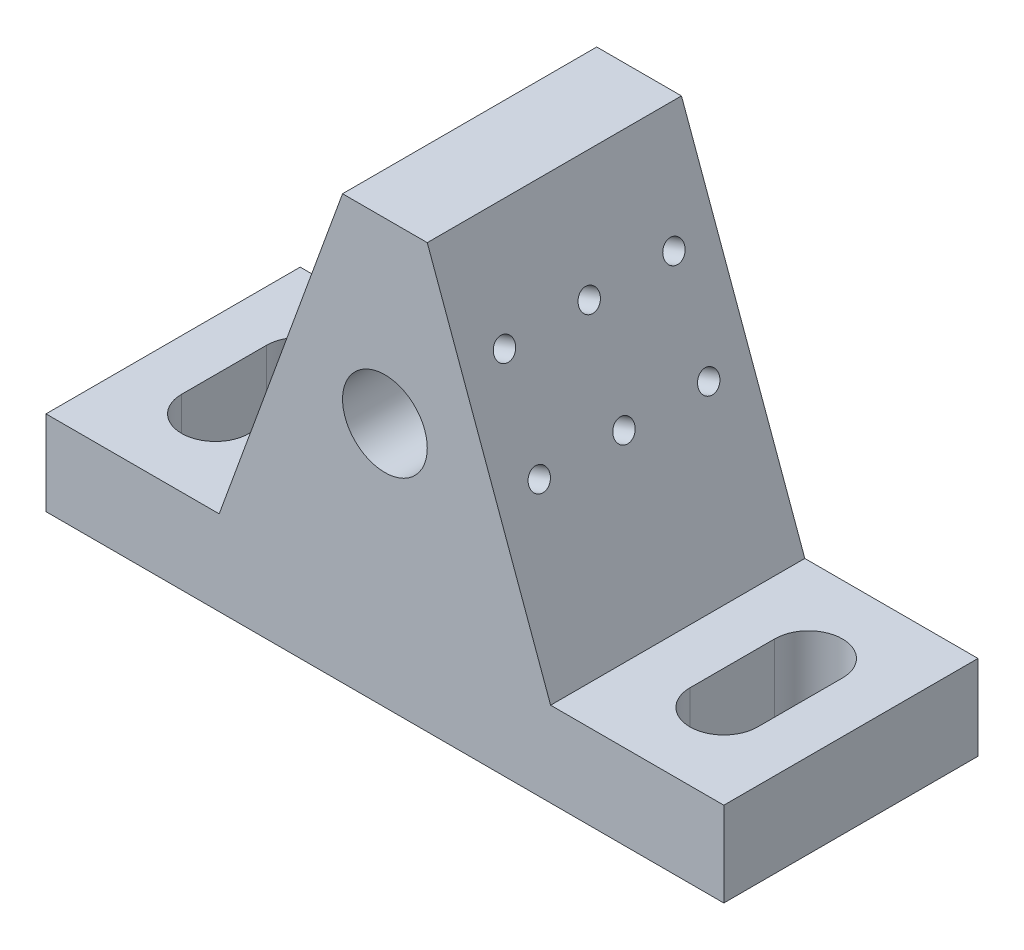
ISO-10303-21;
HEADER;
FILE_DESCRIPTION(('STEP AP214'),'2;1');
FILE_NAME('part.step','',(''),(''),'','','');
FILE_SCHEMA(('AUTOMOTIVE_DESIGN { 1 0 10303 214 1 1 1 1 }'));
ENDSEC;
DATA;
#1=APPLICATION_CONTEXT('core data for automotive mechanical design processes');
#2=APPLICATION_PROTOCOL_DEFINITION('international standard','automotive_design',2000,#1);
#3=PRODUCT_CONTEXT('',#1,'mechanical');
#4=PRODUCT('Part','Part','',(#3));
#5=PRODUCT_RELATED_PRODUCT_CATEGORY('part','',(#4));
#6=PRODUCT_DEFINITION_FORMATION('','',#4);
#7=PRODUCT_DEFINITION_CONTEXT('part definition',#1,'design');
#8=PRODUCT_DEFINITION('design','',#6,#7);
#9=PRODUCT_DEFINITION_SHAPE('','',#8);
#10=(LENGTH_UNIT() NAMED_UNIT(*) SI_UNIT(.MILLI.,.METRE.));
#11=(NAMED_UNIT(*) PLANE_ANGLE_UNIT() SI_UNIT($,.RADIAN.));
#12=(NAMED_UNIT(*) SI_UNIT($,.STERADIAN.) SOLID_ANGLE_UNIT());
#13=UNCERTAINTY_MEASURE_WITH_UNIT(LENGTH_MEASURE(1.E-05),#10,'distance_accuracy_value','');
#14=(GEOMETRIC_REPRESENTATION_CONTEXT(3) GLOBAL_UNCERTAINTY_ASSIGNED_CONTEXT((#13)) GLOBAL_UNIT_ASSIGNED_CONTEXT((#10,
#11,#12)) REPRESENTATION_CONTEXT('',''));
#15=CARTESIAN_POINT('',(0.,0.,0.));
#16=DIRECTION('',(0.,0.,1.));
#17=DIRECTION('',(1.,0.,0.));
#18=AXIS2_PLACEMENT_3D('',#15,#16,#17);
#19=CARTESIAN_POINT('',(-40.,0.,15.));
#20=DIRECTION('',(1.,0.,0.));
#21=DIRECTION('',(0.,0.,-1.));
#22=AXIS2_PLACEMENT_3D('',#19,#20,#21);
#23=PLANE('',#22);
#24=DIRECTION('',(0.,-1.,0.));
#25=VECTOR('',#24,1.);
#26=CARTESIAN_POINT('',(-40.,0.,-15.));
#27=LINE('',#26,#25);
#28=CARTESIAN_POINT('',(-40.,10.,-15.));
#29=VERTEX_POINT('',#28);
#30=CARTESIAN_POINT('',(-40.,0.,-15.));
#31=VERTEX_POINT('',#30);
#32=EDGE_CURVE('E248',#29,#31,#27,.T.);
#33=ORIENTED_EDGE('',*,*,#32,.T.);
#34=DIRECTION('',(0.,0.,-1.));
#35=VECTOR('',#34,1.);
#36=CARTESIAN_POINT('',(-40.,0.,15.));
#37=LINE('',#36,#35);
#38=CARTESIAN_POINT('',(-40.,0.,15.));
#39=VERTEX_POINT('',#38);
#40=EDGE_CURVE('E309',#39,#31,#37,.T.);
#41=ORIENTED_EDGE('',*,*,#40,.F.);
#42=DIRECTION('',(0.,-1.,0.));
#43=VECTOR('',#42,1.);
#44=CARTESIAN_POINT('',(-40.,0.,15.));
#45=LINE('',#44,#43);
#46=CARTESIAN_POINT('',(-40.,10.,15.));
#47=VERTEX_POINT('',#46);
#48=EDGE_CURVE('E255',#47,#39,#45,.T.);
#49=ORIENTED_EDGE('',*,*,#48,.F.);
#50=DIRECTION('',(0.,0.,-1.));
#51=VECTOR('',#50,1.);
#52=CARTESIAN_POINT('',(-40.,10.,15.));
#53=LINE('',#52,#51);
#54=EDGE_CURVE('E273',#47,#29,#53,.T.);
#55=ORIENTED_EDGE('',*,*,#54,.T.);
#56=EDGE_LOOP('',(#33,#41,#49,#55));
#57=FACE_BOUND('',#56,.T.);
#58=ADVANCED_FACE('F40',(#57),#23,.F.);
#59=CARTESIAN_POINT('',(-40.,0.,15.));
#60=DIRECTION('',(0.,1.,0.));
#61=DIRECTION('',(0.,0.,1.));
#62=AXIS2_PLACEMENT_3D('',#59,#60,#61);
#63=PLANE('',#62);
#64=DIRECTION('',(0.,0.,-1.));
#65=VECTOR('',#64,1.);
#66=CARTESIAN_POINT('',(-34.,0.,5.));
#67=LINE('',#66,#65);
#68=CARTESIAN_POINT('',(-34.,0.,5.));
#69=VERTEX_POINT('',#68);
#70=CARTESIAN_POINT('',(-34.,0.,-5.));
#71=VERTEX_POINT('',#70);
#72=EDGE_CURVE('E193',#69,#71,#67,.T.);
#73=ORIENTED_EDGE('',*,*,#72,.F.);
#74=CARTESIAN_POINT('',(-30.,0.,5.));
#75=DIRECTION('',(0.,-1.,0.));
#76=DIRECTION('',(1.,0.,0.));
#77=AXIS2_PLACEMENT_3D('',#74,#75,#76);
#78=CIRCLE('',#77,4.);
#79=CARTESIAN_POINT('',(-26.,0.,5.));
#80=VERTEX_POINT('',#79);
#81=EDGE_CURVE('E220',#80,#69,#78,.T.);
#82=ORIENTED_EDGE('',*,*,#81,.F.);
#83=DIRECTION('',(0.,0.,1.));
#84=VECTOR('',#83,1.);
#85=CARTESIAN_POINT('',(-26.,0.,5.));
#86=LINE('',#85,#84);
#87=CARTESIAN_POINT('',(-26.,0.,-5.));
#88=VERTEX_POINT('',#87);
#89=EDGE_CURVE('E214',#88,#80,#86,.T.);
#90=ORIENTED_EDGE('',*,*,#89,.F.);
#91=CARTESIAN_POINT('',(-30.,0.,-5.));
#92=DIRECTION('',(0.,-1.,0.));
#93=DIRECTION('',(1.,0.,0.));
#94=AXIS2_PLACEMENT_3D('',#91,#92,#93);
#95=CIRCLE('',#94,4.);
#96=EDGE_CURVE('E206',#71,#88,#95,.T.);
#97=ORIENTED_EDGE('',*,*,#96,.F.);
#98=EDGE_LOOP('',(#73,#82,#90,#97));
#99=FACE_BOUND('',#98,.T.);
#100=DIRECTION('',(0.,0.,1.));
#101=VECTOR('',#100,1.);
#102=CARTESIAN_POINT('',(26.,0.,5.));
#103=LINE('',#102,#101);
#104=CARTESIAN_POINT('',(26.,0.,-5.));
#105=VERTEX_POINT('',#104);
#106=CARTESIAN_POINT('',(26.,0.,5.));
#107=VERTEX_POINT('',#106);
#108=EDGE_CURVE('E233',#105,#107,#103,.T.);
#109=ORIENTED_EDGE('',*,*,#108,.T.);
#110=CARTESIAN_POINT('',(30.,0.,5.));
#111=DIRECTION('',(0.,1.,0.));
#112=DIRECTION('',(-1.,0.,0.));
#113=AXIS2_PLACEMENT_3D('',#110,#111,#112);
#114=CIRCLE('',#113,4.);
#115=CARTESIAN_POINT('',(34.,0.,5.));
#116=VERTEX_POINT('',#115);
#117=EDGE_CURVE('E223',#107,#116,#114,.T.);
#118=ORIENTED_EDGE('',*,*,#117,.T.);
#119=DIRECTION('',(0.,0.,-1.));
#120=VECTOR('',#119,1.);
#121=CARTESIAN_POINT('',(34.,0.,5.));
#122=LINE('',#121,#120);
#123=CARTESIAN_POINT('',(34.,0.,-5.));
#124=VERTEX_POINT('',#123);
#125=EDGE_CURVE('E226',#116,#124,#122,.T.);
#126=ORIENTED_EDGE('',*,*,#125,.T.);
#127=CARTESIAN_POINT('',(30.,0.,-5.));
#128=DIRECTION('',(0.,1.,0.));
#129=DIRECTION('',(-1.,0.,0.));
#130=AXIS2_PLACEMENT_3D('',#127,#128,#129);
#131=CIRCLE('',#130,4.);
#132=EDGE_CURVE('E230',#124,#105,#131,.T.);
#133=ORIENTED_EDGE('',*,*,#132,.T.);
#134=EDGE_LOOP('',(#109,#118,#126,#133));
#135=FACE_BOUND('',#134,.T.);
#136=DIRECTION('',(1.,0.,0.));
#137=VECTOR('',#136,1.);
#138=CARTESIAN_POINT('',(-40.,0.,-15.));
#139=LINE('',#138,#137);
#140=CARTESIAN_POINT('',(40.,0.,-15.));
#141=VERTEX_POINT('',#140);
#142=EDGE_CURVE('E276',#31,#141,#139,.T.);
#143=ORIENTED_EDGE('',*,*,#142,.T.);
#144=DIRECTION('',(0.,0.,-1.));
#145=VECTOR('',#144,1.);
#146=CARTESIAN_POINT('',(40.,0.,15.));
#147=LINE('',#146,#145);
#148=CARTESIAN_POINT('',(40.,0.,15.));
#149=VERTEX_POINT('',#148);
#150=EDGE_CURVE('E306',#149,#141,#147,.T.);
#151=ORIENTED_EDGE('',*,*,#150,.F.);
#152=DIRECTION('',(1.,0.,0.));
#153=VECTOR('',#152,1.);
#154=CARTESIAN_POINT('',(-40.,0.,15.));
#155=LINE('',#154,#153);
#156=EDGE_CURVE('E258',#39,#149,#155,.T.);
#157=ORIENTED_EDGE('',*,*,#156,.F.);
#158=ORIENTED_EDGE('',*,*,#40,.T.);
#159=EDGE_LOOP('',(#143,#151,#157,#158));
#160=FACE_BOUND('',#159,.T.);
#161=ADVANCED_FACE('F352',(#99,#135,#160),#63,.F.);
#162=CARTESIAN_POINT('',(40.,0.,15.));
#163=DIRECTION('',(-1.,0.,0.));
#164=DIRECTION('',(0.,0.,1.));
#165=AXIS2_PLACEMENT_3D('',#162,#163,#164);
#166=PLANE('',#165);
#167=DIRECTION('',(0.,1.,0.));
#168=VECTOR('',#167,1.);
#169=CARTESIAN_POINT('',(40.,0.,-15.));
#170=LINE('',#169,#168);
#171=CARTESIAN_POINT('',(40.,10.,-15.));
#172=VERTEX_POINT('',#171);
#173=EDGE_CURVE('E278',#141,#172,#170,.T.);
#174=ORIENTED_EDGE('',*,*,#173,.T.);
#175=DIRECTION('',(0.,0.,-1.));
#176=VECTOR('',#175,1.);
#177=CARTESIAN_POINT('',(40.,10.,15.));
#178=LINE('',#177,#176);
#179=CARTESIAN_POINT('',(40.,10.,15.));
#180=VERTEX_POINT('',#179);
#181=EDGE_CURVE('E303',#180,#172,#178,.T.);
#182=ORIENTED_EDGE('',*,*,#181,.F.);
#183=DIRECTION('',(0.,1.,0.));
#184=VECTOR('',#183,1.);
#185=CARTESIAN_POINT('',(40.,0.,15.));
#186=LINE('',#185,#184);
#187=EDGE_CURVE('E261',#149,#180,#186,.T.);
#188=ORIENTED_EDGE('',*,*,#187,.F.);
#189=ORIENTED_EDGE('',*,*,#150,.T.);
#190=EDGE_LOOP('',(#174,#182,#188,#189));
#191=FACE_BOUND('',#190,.T.);
#192=ADVANCED_FACE('F346',(#191),#166,.F.);
#193=CARTESIAN_POINT('',(40.,10.,15.));
#194=DIRECTION('',(0.,-1.,0.));
#195=DIRECTION('',(1.,0.,0.));
#196=AXIS2_PLACEMENT_3D('',#193,#194,#195);
#197=PLANE('',#196);
#198=DIRECTION('',(0.,0.,-1.));
#199=VECTOR('',#198,1.);
#200=CARTESIAN_POINT('',(34.,10.,5.));
#201=LINE('',#200,#199);
#202=CARTESIAN_POINT('',(34.,10.,5.));
#203=VERTEX_POINT('',#202);
#204=CARTESIAN_POINT('',(34.,10.,-5.));
#205=VERTEX_POINT('',#204);
#206=EDGE_CURVE('E238',#203,#205,#201,.T.);
#207=ORIENTED_EDGE('',*,*,#206,.F.);
#208=CARTESIAN_POINT('',(30.,10.,5.));
#209=DIRECTION('',(0.,1.,0.));
#210=DIRECTION('',(-1.,0.,0.));
#211=AXIS2_PLACEMENT_3D('',#208,#209,#210);
#212=CIRCLE('',#211,4.);
#213=CARTESIAN_POINT('',(26.,10.,5.));
#214=VERTEX_POINT('',#213);
#215=EDGE_CURVE('E222',#214,#203,#212,.T.);
#216=ORIENTED_EDGE('',*,*,#215,.F.);
#217=DIRECTION('',(0.,0.,1.));
#218=VECTOR('',#217,1.);
#219=CARTESIAN_POINT('',(26.,10.,5.));
#220=LINE('',#219,#218);
#221=CARTESIAN_POINT('',(26.,10.,-5.));
#222=VERTEX_POINT('',#221);
#223=EDGE_CURVE('E227',#222,#214,#220,.T.);
#224=ORIENTED_EDGE('',*,*,#223,.F.);
#225=CARTESIAN_POINT('',(30.,10.,-5.));
#226=DIRECTION('',(0.,1.,0.));
#227=DIRECTION('',(-1.,0.,0.));
#228=AXIS2_PLACEMENT_3D('',#225,#226,#227);
#229=CIRCLE('',#228,4.);
#230=EDGE_CURVE('E241',#205,#222,#229,.T.);
#231=ORIENTED_EDGE('',*,*,#230,.F.);
#232=EDGE_LOOP('',(#207,#216,#224,#231));
#233=FACE_BOUND('',#232,.T.);
#234=DIRECTION('',(-1.,0.,0.));
#235=VECTOR('',#234,1.);
#236=CARTESIAN_POINT('',(40.,10.,-15.));
#237=LINE('',#236,#235);
#238=CARTESIAN_POINT('',(19.558809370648,10.,-15.));
#239=VERTEX_POINT('',#238);
#240=EDGE_CURVE('E280',#172,#239,#237,.T.);
#241=ORIENTED_EDGE('',*,*,#240,.T.);
#242=DIRECTION('',(0.,0.,-1.));
#243=VECTOR('',#242,1.);
#244=CARTESIAN_POINT('',(19.558809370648,10.,15.));
#245=LINE('',#244,#243);
#246=CARTESIAN_POINT('',(19.558809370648,10.,15.));
#247=VERTEX_POINT('',#246);
#248=EDGE_CURVE('E300',#247,#239,#245,.T.);
#249=ORIENTED_EDGE('',*,*,#248,.F.);
#250=DIRECTION('',(-1.,0.,0.));
#251=VECTOR('',#250,1.);
#252=CARTESIAN_POINT('',(40.,10.,15.));
#253=LINE('',#252,#251);
#254=EDGE_CURVE('E263',#180,#247,#253,.T.);
#255=ORIENTED_EDGE('',*,*,#254,.F.);
#256=ORIENTED_EDGE('',*,*,#181,.T.);
#257=EDGE_LOOP('',(#241,#249,#255,#256));
#258=FACE_BOUND('',#257,.T.);
#259=ADVANCED_FACE('F336',(#233,#258),#197,.F.);
#260=CARTESIAN_POINT('',(19.558809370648,10.,15.));
#261=DIRECTION('',(-0.939692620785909,-0.342020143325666,0.));
#262=DIRECTION('',(0.342020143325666,-0.93969262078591,0.));
#263=AXIS2_PLACEMENT_3D('',#260,#261,#262);
#264=PLANE('',#263);
#265=CARTESIAN_POINT('',(13.2165018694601,27.4253466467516,0.));
#266=DIRECTION('',(0.939692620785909,0.342020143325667,0.));
#267=DIRECTION('',(-0.342020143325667,0.939692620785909,0.));
#268=AXIS2_PLACEMENT_3D('',#265,#266,#267);
#269=CIRCLE('',#268,1.25);
#270=CARTESIAN_POINT('',(12.788976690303,28.599962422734,0.));
#271=VERTEX_POINT('',#270);
#272=EDGE_CURVE('E174',#271,#271,#269,.T.);
#273=ORIENTED_EDGE('',*,*,#272,.F.);
#274=EDGE_LOOP('',(#273));
#275=FACE_BOUND('',#274,.T.);
#276=CARTESIAN_POINT('',(13.2165018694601,27.4253466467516,10.));
#277=DIRECTION('',(0.939692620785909,0.342020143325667,0.));
#278=DIRECTION('',(-0.342020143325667,0.939692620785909,0.));
#279=AXIS2_PLACEMENT_3D('',#276,#277,#278);
#280=CIRCLE('',#279,1.25);
#281=CARTESIAN_POINT('',(12.788976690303,28.599962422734,10.));
#282=VERTEX_POINT('',#281);
#283=EDGE_CURVE('E173',#282,#282,#280,.T.);
#284=ORIENTED_EDGE('',*,*,#283,.F.);
#285=EDGE_LOOP('',(#284));
#286=FACE_BOUND('',#285,.T.);
#287=DIRECTION('',(-0.342020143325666,0.939692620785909,0.));
#288=VECTOR('',#287,1.);
#289=CARTESIAN_POINT('',(19.558809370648,10.,-15.));
#290=LINE('',#289,#288);
#291=CARTESIAN_POINT('',(5.,50.,-15.));
#292=VERTEX_POINT('',#291);
#293=EDGE_CURVE('E282',#239,#292,#290,.T.);
#294=ORIENTED_EDGE('',*,*,#293,.T.);
#295=DIRECTION('',(0.,0.,-1.));
#296=VECTOR('',#295,1.);
#297=CARTESIAN_POINT('',(5.,50.,15.));
#298=LINE('',#297,#296);
#299=CARTESIAN_POINT('',(5.,50.,15.));
#300=VERTEX_POINT('',#299);
#301=EDGE_CURVE('E297',#300,#292,#298,.T.);
#302=ORIENTED_EDGE('',*,*,#301,.F.);
#303=DIRECTION('',(-0.342020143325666,0.939692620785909,0.));
#304=VECTOR('',#303,1.);
#305=CARTESIAN_POINT('',(19.558809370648,10.,15.));
#306=LINE('',#305,#304);
#307=EDGE_CURVE('E265',#247,#300,#306,.T.);
#308=ORIENTED_EDGE('',*,*,#307,.F.);
#309=ORIENTED_EDGE('',*,*,#248,.T.);
#310=EDGE_LOOP('',(#294,#302,#308,#309));
#311=FACE_BOUND('',#310,.T.);
#312=CARTESIAN_POINT('',(13.2165018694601,27.4253466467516,-10.));
#313=DIRECTION('',(0.939692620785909,0.342020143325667,0.));
#314=DIRECTION('',(-0.342020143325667,0.939692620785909,0.));
#315=AXIS2_PLACEMENT_3D('',#312,#313,#314);
#316=CIRCLE('',#315,1.25);
#317=CARTESIAN_POINT('',(12.788976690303,28.599962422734,-10.));
#318=VERTEX_POINT('',#317);
#319=EDGE_CURVE('E312',#318,#318,#316,.T.);
#320=ORIENTED_EDGE('',*,*,#319,.F.);
#321=EDGE_LOOP('',(#320));
#322=FACE_BOUND('',#321,.T.);
#323=CARTESIAN_POINT('',(9.11226014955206,38.7016580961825,10.));
#324=DIRECTION('',(0.939692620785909,0.342020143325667,0.));
#325=DIRECTION('',(-0.342020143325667,0.939692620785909,0.));
#326=AXIS2_PLACEMENT_3D('',#323,#324,#325);
#327=CIRCLE('',#326,1.25);
#328=CARTESIAN_POINT('',(8.68473497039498,39.8762738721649,10.));
#329=VERTEX_POINT('',#328);
#330=EDGE_CURVE('E318',#329,#329,#327,.T.);
#331=ORIENTED_EDGE('',*,*,#330,.F.);
#332=EDGE_LOOP('',(#331));
#333=FACE_BOUND('',#332,.T.);
#334=CARTESIAN_POINT('',(9.11226014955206,38.7016580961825,0.));
#335=DIRECTION('',(0.939692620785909,0.342020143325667,0.));
#336=DIRECTION('',(-0.342020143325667,0.939692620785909,0.));
#337=AXIS2_PLACEMENT_3D('',#334,#335,#336);
#338=CIRCLE('',#337,1.25);
#339=CARTESIAN_POINT('',(8.68473497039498,39.8762738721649,0.));
#340=VERTEX_POINT('',#339);
#341=EDGE_CURVE('E324',#340,#340,#338,.T.);
#342=ORIENTED_EDGE('',*,*,#341,.F.);
#343=EDGE_LOOP('',(#342));
#344=FACE_BOUND('',#343,.T.);
#345=CARTESIAN_POINT('',(9.11226014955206,38.7016580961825,-10.));
#346=DIRECTION('',(0.939692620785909,0.342020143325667,0.));
#347=DIRECTION('',(-0.342020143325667,0.939692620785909,0.));
#348=AXIS2_PLACEMENT_3D('',#345,#346,#347);
#349=CIRCLE('',#348,1.25);
#350=CARTESIAN_POINT('',(8.68473497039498,39.8762738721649,-10.));
#351=VERTEX_POINT('',#350);
#352=EDGE_CURVE('E48',#351,#351,#349,.T.);
#353=ORIENTED_EDGE('',*,*,#352,.F.);
#354=EDGE_LOOP('',(#353));
#355=FACE_BOUND('',#354,.T.);
#356=ADVANCED_FACE('F333',(#275,#286,#311,#322,#333,#344,#355),#264,.F.);
#357=CARTESIAN_POINT('',(5.,50.,15.));
#358=DIRECTION('',(0.,-1.,0.));
#359=DIRECTION('',(0.,0.,-1.));
#360=AXIS2_PLACEMENT_3D('',#357,#358,#359);
#361=PLANE('',#360);
#362=DIRECTION('',(-1.,0.,0.));
#363=VECTOR('',#362,1.);
#364=CARTESIAN_POINT('',(5.,50.,-15.));
#365=LINE('',#364,#363);
#366=CARTESIAN_POINT('',(-5.,50.,-15.));
#367=VERTEX_POINT('',#366);
#368=EDGE_CURVE('E284',#292,#367,#365,.T.);
#369=ORIENTED_EDGE('',*,*,#368,.T.);
#370=DIRECTION('',(0.,0.,-1.));
#371=VECTOR('',#370,1.);
#372=CARTESIAN_POINT('',(-5.,50.,15.));
#373=LINE('',#372,#371);
#374=CARTESIAN_POINT('',(-5.,50.,15.));
#375=VERTEX_POINT('',#374);
#376=EDGE_CURVE('E294',#375,#367,#373,.T.);
#377=ORIENTED_EDGE('',*,*,#376,.F.);
#378=DIRECTION('',(-1.,0.,0.));
#379=VECTOR('',#378,1.);
#380=CARTESIAN_POINT('',(5.,50.,15.));
#381=LINE('',#380,#379);
#382=EDGE_CURVE('E267',#300,#375,#381,.T.);
#383=ORIENTED_EDGE('',*,*,#382,.F.);
#384=ORIENTED_EDGE('',*,*,#301,.T.);
#385=EDGE_LOOP('',(#369,#377,#383,#384));
#386=FACE_BOUND('',#385,.T.);
#387=ADVANCED_FACE('F335',(#386),#361,.F.);
#388=CARTESIAN_POINT('',(-19.558809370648,10.,15.));
#389=DIRECTION('',(0.939692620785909,-0.342020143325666,0.));
#390=DIRECTION('',(0.342020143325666,0.93969262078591,0.));
#391=AXIS2_PLACEMENT_3D('',#388,#389,#390);
#392=PLANE('',#391);
#393=DIRECTION('',(-0.342020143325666,-0.939692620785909,0.));
#394=VECTOR('',#393,1.);
#395=CARTESIAN_POINT('',(-19.558809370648,10.,-15.));
#396=LINE('',#395,#394);
#397=CARTESIAN_POINT('',(-19.558809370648,10.,-15.));
#398=VERTEX_POINT('',#397);
#399=EDGE_CURVE('E286',#367,#398,#396,.T.);
#400=ORIENTED_EDGE('',*,*,#399,.T.);
#401=DIRECTION('',(0.,0.,-1.));
#402=VECTOR('',#401,1.);
#403=CARTESIAN_POINT('',(-19.558809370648,10.,15.));
#404=LINE('',#403,#402);
#405=CARTESIAN_POINT('',(-19.558809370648,10.,15.));
#406=VERTEX_POINT('',#405);
#407=EDGE_CURVE('E291',#406,#398,#404,.T.);
#408=ORIENTED_EDGE('',*,*,#407,.F.);
#409=DIRECTION('',(-0.342020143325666,-0.939692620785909,0.));
#410=VECTOR('',#409,1.);
#411=CARTESIAN_POINT('',(-19.558809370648,10.,15.));
#412=LINE('',#411,#410);
#413=EDGE_CURVE('E269',#375,#406,#412,.T.);
#414=ORIENTED_EDGE('',*,*,#413,.F.);
#415=ORIENTED_EDGE('',*,*,#376,.T.);
#416=EDGE_LOOP('',(#400,#408,#414,#415));
#417=FACE_BOUND('',#416,.T.);
#418=ADVANCED_FACE('F343',(#417),#392,.F.);
#419=CARTESIAN_POINT('',(-40.,10.,15.));
#420=DIRECTION('',(0.,-1.,0.));
#421=DIRECTION('',(1.,0.,0.));
#422=AXIS2_PLACEMENT_3D('',#419,#420,#421);
#423=PLANE('',#422);
#424=DIRECTION('',(0.,0.,1.));
#425=VECTOR('',#424,1.);
#426=CARTESIAN_POINT('',(-26.,10.,5.));
#427=LINE('',#426,#425);
#428=CARTESIAN_POINT('',(-26.,10.,-5.));
#429=VERTEX_POINT('',#428);
#430=CARTESIAN_POINT('',(-26.,10.,5.));
#431=VERTEX_POINT('',#430);
#432=EDGE_CURVE('E209',#429,#431,#427,.T.);
#433=ORIENTED_EDGE('',*,*,#432,.T.);
#434=CARTESIAN_POINT('',(-30.,10.,5.));
#435=DIRECTION('',(0.,-1.,0.));
#436=DIRECTION('',(1.,0.,0.));
#437=AXIS2_PLACEMENT_3D('',#434,#435,#436);
#438=CIRCLE('',#437,4.);
#439=CARTESIAN_POINT('',(-34.,10.,5.));
#440=VERTEX_POINT('',#439);
#441=EDGE_CURVE('E217',#431,#440,#438,.T.);
#442=ORIENTED_EDGE('',*,*,#441,.T.);
#443=DIRECTION('',(0.,0.,-1.));
#444=VECTOR('',#443,1.);
#445=CARTESIAN_POINT('',(-34.,10.,5.));
#446=LINE('',#445,#444);
#447=CARTESIAN_POINT('',(-34.,10.,-5.));
#448=VERTEX_POINT('',#447);
#449=EDGE_CURVE('E188',#440,#448,#446,.T.);
#450=ORIENTED_EDGE('',*,*,#449,.T.);
#451=CARTESIAN_POINT('',(-30.,10.,-5.));
#452=DIRECTION('',(0.,-1.,0.));
#453=DIRECTION('',(1.,0.,0.));
#454=AXIS2_PLACEMENT_3D('',#451,#452,#453);
#455=CIRCLE('',#454,4.);
#456=EDGE_CURVE('E201',#448,#429,#455,.T.);
#457=ORIENTED_EDGE('',*,*,#456,.T.);
#458=EDGE_LOOP('',(#433,#442,#450,#457));
#459=FACE_BOUND('',#458,.T.);
#460=DIRECTION('',(-1.,0.,0.));
#461=VECTOR('',#460,1.);
#462=CARTESIAN_POINT('',(-40.,10.,-15.));
#463=LINE('',#462,#461);
#464=EDGE_CURVE('E259',#398,#29,#463,.T.);
#465=ORIENTED_EDGE('',*,*,#464,.T.);
#466=ORIENTED_EDGE('',*,*,#54,.F.);
#467=DIRECTION('',(-1.,0.,0.));
#468=VECTOR('',#467,1.);
#469=CARTESIAN_POINT('',(-40.,10.,15.));
#470=LINE('',#469,#468);
#471=EDGE_CURVE('E271',#406,#47,#470,.T.);
#472=ORIENTED_EDGE('',*,*,#471,.F.);
#473=ORIENTED_EDGE('',*,*,#407,.T.);
#474=EDGE_LOOP('',(#465,#466,#472,#473));
#475=FACE_BOUND('',#474,.T.);
#476=ADVANCED_FACE('F539',(#459,#475),#423,.F.);
#477=CARTESIAN_POINT('',(-40.,10.,15.));
#478=DIRECTION('',(0.,0.,-1.));
#479=DIRECTION('',(-1.,0.,0.));
#480=AXIS2_PLACEMENT_3D('',#477,#478,#479);
#481=PLANE('',#480);
#482=CARTESIAN_POINT('',(0.,29.,15.));
#483=DIRECTION('',(0.,0.,1.));
#484=DIRECTION('',(1.,0.,0.));
#485=AXIS2_PLACEMENT_3D('',#482,#483,#484);
#486=CIRCLE('',#485,5.);
#487=CARTESIAN_POINT('',(5.,29.,15.));
#488=VERTEX_POINT('',#487);
#489=EDGE_CURVE('E184',#488,#488,#486,.T.);
#490=ORIENTED_EDGE('',*,*,#489,.F.);
#491=EDGE_LOOP('',(#490));
#492=FACE_BOUND('',#491,.T.);
#493=ORIENTED_EDGE('',*,*,#48,.T.);
#494=ORIENTED_EDGE('',*,*,#156,.T.);
#495=ORIENTED_EDGE('',*,*,#187,.T.);
#496=ORIENTED_EDGE('',*,*,#254,.T.);
#497=ORIENTED_EDGE('',*,*,#307,.T.);
#498=ORIENTED_EDGE('',*,*,#382,.T.);
#499=ORIENTED_EDGE('',*,*,#413,.T.);
#500=ORIENTED_EDGE('',*,*,#471,.T.);
#501=EDGE_LOOP('',(#493,#494,#495,#496,#497,#498,#499,#500));
#502=FACE_BOUND('',#501,.T.);
#503=ADVANCED_FACE('F532',(#492,#502),#481,.F.);
#504=CARTESIAN_POINT('',(-40.,10.,-15.));
#505=DIRECTION('',(0.,0.,-1.));
#506=DIRECTION('',(-1.,0.,0.));
#507=AXIS2_PLACEMENT_3D('',#504,#505,#506);
#508=PLANE('',#507);
#509=CARTESIAN_POINT('',(0.,29.,-15.));
#510=DIRECTION('',(0.,0.,1.));
#511=DIRECTION('',(1.,0.,0.));
#512=AXIS2_PLACEMENT_3D('',#509,#510,#511);
#513=CIRCLE('',#512,5.);
#514=CARTESIAN_POINT('',(5.,29.,-15.));
#515=VERTEX_POINT('',#514);
#516=EDGE_CURVE('E185',#515,#515,#513,.T.);
#517=ORIENTED_EDGE('',*,*,#516,.T.);
#518=EDGE_LOOP('',(#517));
#519=FACE_BOUND('',#518,.T.);
#520=ORIENTED_EDGE('',*,*,#32,.F.);
#521=ORIENTED_EDGE('',*,*,#464,.F.);
#522=ORIENTED_EDGE('',*,*,#399,.F.);
#523=ORIENTED_EDGE('',*,*,#368,.F.);
#524=ORIENTED_EDGE('',*,*,#293,.F.);
#525=ORIENTED_EDGE('',*,*,#240,.F.);
#526=ORIENTED_EDGE('',*,*,#173,.F.);
#527=ORIENTED_EDGE('',*,*,#142,.F.);
#528=EDGE_LOOP('',(#520,#521,#522,#523,#524,#525,#526,#527));
#529=FACE_BOUND('',#528,.T.);
#530=ADVANCED_FACE('F524',(#519,#529),#508,.T.);
#531=CARTESIAN_POINT('',(30.,0.,5.));
#532=DIRECTION('',(0.,1.,0.));
#533=DIRECTION('',(-1.,0.,0.));
#534=AXIS2_PLACEMENT_3D('',#531,#532,#533);
#535=CYLINDRICAL_SURFACE('',#534,4.);
#536=ORIENTED_EDGE('',*,*,#215,.T.);
#537=DIRECTION('',(0.,1.,0.));
#538=VECTOR('',#537,1.);
#539=CARTESIAN_POINT('',(34.,0.,5.));
#540=LINE('',#539,#538);
#541=EDGE_CURVE('E236',#116,#203,#540,.T.);
#542=ORIENTED_EDGE('',*,*,#541,.F.);
#543=ORIENTED_EDGE('',*,*,#117,.F.);
#544=DIRECTION('',(0.,1.,0.));
#545=VECTOR('',#544,1.);
#546=CARTESIAN_POINT('',(26.,0.,5.));
#547=LINE('',#546,#545);
#548=EDGE_CURVE('E246',#107,#214,#547,.T.);
#549=ORIENTED_EDGE('',*,*,#548,.T.);
#550=EDGE_LOOP('',(#536,#542,#543,#549));
#551=FACE_BOUND('',#550,.T.);
#552=ADVANCED_FACE('F516',(#551),#535,.F.);
#553=CARTESIAN_POINT('',(26.,0.,5.));
#554=DIRECTION('',(-1.,0.,0.));
#555=DIRECTION('',(0.,-1.,0.));
#556=AXIS2_PLACEMENT_3D('',#553,#554,#555);
#557=PLANE('',#556);
#558=ORIENTED_EDGE('',*,*,#223,.T.);
#559=ORIENTED_EDGE('',*,*,#548,.F.);
#560=ORIENTED_EDGE('',*,*,#108,.F.);
#561=DIRECTION('',(0.,1.,0.));
#562=VECTOR('',#561,1.);
#563=CARTESIAN_POINT('',(26.,0.,-5.));
#564=LINE('',#563,#562);
#565=EDGE_CURVE('E249',#105,#222,#564,.T.);
#566=ORIENTED_EDGE('',*,*,#565,.T.);
#567=EDGE_LOOP('',(#558,#559,#560,#566));
#568=FACE_BOUND('',#567,.T.);
#569=ADVANCED_FACE('F508',(#568),#557,.F.);
#570=CARTESIAN_POINT('',(30.,0.,-5.));
#571=DIRECTION('',(0.,1.,0.));
#572=DIRECTION('',(-1.,0.,0.));
#573=AXIS2_PLACEMENT_3D('',#570,#571,#572);
#574=CYLINDRICAL_SURFACE('',#573,4.);
#575=ORIENTED_EDGE('',*,*,#230,.T.);
#576=ORIENTED_EDGE('',*,*,#565,.F.);
#577=ORIENTED_EDGE('',*,*,#132,.F.);
#578=DIRECTION('',(0.,1.,0.));
#579=VECTOR('',#578,1.);
#580=CARTESIAN_POINT('',(34.,0.,-5.));
#581=LINE('',#580,#579);
#582=EDGE_CURVE('E251',#124,#205,#581,.T.);
#583=ORIENTED_EDGE('',*,*,#582,.T.);
#584=EDGE_LOOP('',(#575,#576,#577,#583));
#585=FACE_BOUND('',#584,.T.);
#586=ADVANCED_FACE('F499',(#585),#574,.F.);
#587=CARTESIAN_POINT('',(34.,0.,5.));
#588=DIRECTION('',(1.,0.,0.));
#589=DIRECTION('',(0.,1.,0.));
#590=AXIS2_PLACEMENT_3D('',#587,#588,#589);
#591=PLANE('',#590);
#592=ORIENTED_EDGE('',*,*,#206,.T.);
#593=ORIENTED_EDGE('',*,*,#582,.F.);
#594=ORIENTED_EDGE('',*,*,#125,.F.);
#595=ORIENTED_EDGE('',*,*,#541,.T.);
#596=EDGE_LOOP('',(#592,#593,#594,#595));
#597=FACE_BOUND('',#596,.T.);
#598=ADVANCED_FACE('F490',(#597),#591,.F.);
#599=CARTESIAN_POINT('',(-30.,0.,5.));
#600=DIRECTION('',(0.,1.,0.));
#601=DIRECTION('',(1.,0.,0.));
#602=AXIS2_PLACEMENT_3D('',#599,#600,#601);
#603=CYLINDRICAL_SURFACE('',#602,4.);
#604=ORIENTED_EDGE('',*,*,#441,.F.);
#605=DIRECTION('',(0.,1.,0.));
#606=VECTOR('',#605,1.);
#607=CARTESIAN_POINT('',(-26.,0.,5.));
#608=LINE('',#607,#606);
#609=EDGE_CURVE('E212',#80,#431,#608,.T.);
#610=ORIENTED_EDGE('',*,*,#609,.F.);
#611=ORIENTED_EDGE('',*,*,#81,.T.);
#612=DIRECTION('',(0.,1.,0.));
#613=VECTOR('',#612,1.);
#614=CARTESIAN_POINT('',(-34.,0.,5.));
#615=LINE('',#614,#613);
#616=EDGE_CURVE('E199',#69,#440,#615,.T.);
#617=ORIENTED_EDGE('',*,*,#616,.T.);
#618=EDGE_LOOP('',(#604,#610,#611,#617));
#619=FACE_BOUND('',#618,.T.);
#620=ADVANCED_FACE('F482',(#619),#603,.F.);
#621=CARTESIAN_POINT('',(-26.,0.,5.));
#622=DIRECTION('',(1.,0.,0.));
#623=DIRECTION('',(0.,-1.,0.));
#624=AXIS2_PLACEMENT_3D('',#621,#622,#623);
#625=PLANE('',#624);
#626=ORIENTED_EDGE('',*,*,#432,.F.);
#627=DIRECTION('',(0.,1.,0.));
#628=VECTOR('',#627,1.);
#629=CARTESIAN_POINT('',(-26.,0.,-5.));
#630=LINE('',#629,#628);
#631=EDGE_CURVE('E204',#88,#429,#630,.T.);
#632=ORIENTED_EDGE('',*,*,#631,.F.);
#633=ORIENTED_EDGE('',*,*,#89,.T.);
#634=ORIENTED_EDGE('',*,*,#609,.T.);
#635=EDGE_LOOP('',(#626,#632,#633,#634));
#636=FACE_BOUND('',#635,.T.);
#637=ADVANCED_FACE('F474',(#636),#625,.F.);
#638=CARTESIAN_POINT('',(-30.,0.,-5.));
#639=DIRECTION('',(0.,1.,0.));
#640=DIRECTION('',(1.,0.,0.));
#641=AXIS2_PLACEMENT_3D('',#638,#639,#640);
#642=CYLINDRICAL_SURFACE('',#641,4.);
#643=ORIENTED_EDGE('',*,*,#456,.F.);
#644=DIRECTION('',(0.,1.,0.));
#645=VECTOR('',#644,1.);
#646=CARTESIAN_POINT('',(-34.,0.,-5.));
#647=LINE('',#646,#645);
#648=EDGE_CURVE('E196',#71,#448,#647,.T.);
#649=ORIENTED_EDGE('',*,*,#648,.F.);
#650=ORIENTED_EDGE('',*,*,#96,.T.);
#651=ORIENTED_EDGE('',*,*,#631,.T.);
#652=EDGE_LOOP('',(#643,#649,#650,#651));
#653=FACE_BOUND('',#652,.T.);
#654=ADVANCED_FACE('F465',(#653),#642,.F.);
#655=CARTESIAN_POINT('',(-34.,0.,5.));
#656=DIRECTION('',(-1.,0.,0.));
#657=DIRECTION('',(0.,1.,0.));
#658=AXIS2_PLACEMENT_3D('',#655,#656,#657);
#659=PLANE('',#658);
#660=ORIENTED_EDGE('',*,*,#449,.F.);
#661=ORIENTED_EDGE('',*,*,#616,.F.);
#662=ORIENTED_EDGE('',*,*,#72,.T.);
#663=ORIENTED_EDGE('',*,*,#648,.T.);
#664=EDGE_LOOP('',(#660,#661,#662,#663));
#665=FACE_BOUND('',#664,.T.);
#666=ADVANCED_FACE('F456',(#665),#659,.F.);
#667=CARTESIAN_POINT('',(0.,29.,-15.));
#668=DIRECTION('',(0.,0.,1.));
#669=DIRECTION('',(1.,0.,0.));
#670=AXIS2_PLACEMENT_3D('',#667,#668,#669);
#671=CYLINDRICAL_SURFACE('',#670,5.);
#672=ORIENTED_EDGE('',*,*,#516,.F.);
#673=EDGE_LOOP('',(#672));
#674=FACE_BOUND('',#673,.T.);
#675=ORIENTED_EDGE('',*,*,#489,.T.);
#676=EDGE_LOOP('',(#675));
#677=FACE_BOUND('',#676,.T.);
#678=ADVANCED_FACE('F447',(#674,#677),#671,.F.);
#679=CARTESIAN_POINT('',(6.16880721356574,24.8601955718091,10.));
#680=DIRECTION('',(0.939692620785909,0.342020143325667,0.));
#681=DIRECTION('',(-0.342020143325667,0.939692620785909,0.));
#682=AXIS2_PLACEMENT_3D('',#679,#680,#681);
#683=CONICAL_SURFACE('',#682,1.25,1.02974425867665);
#684=CARTESIAN_POINT('',(5.46302685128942,24.6033125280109,10.));
#685=VERTEX_POINT('',#684);
#686=VERTEX_LOOP('',#685);
#687=FACE_BOUND('',#686,.T.);
#688=CARTESIAN_POINT('',(6.16880721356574,24.8601955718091,10.));
#689=DIRECTION('',(0.939692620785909,0.342020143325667,0.));
#690=DIRECTION('',(-0.342020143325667,0.939692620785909,0.));
#691=AXIS2_PLACEMENT_3D('',#688,#689,#690);
#692=CIRCLE('',#691,1.25);
#693=CARTESIAN_POINT('',(5.74128203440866,26.0348113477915,10.));
#694=VERTEX_POINT('',#693);
#695=EDGE_CURVE('E177',#694,#694,#692,.T.);
#696=ORIENTED_EDGE('',*,*,#695,.T.);
#697=EDGE_LOOP('',(#696));
#698=FACE_BOUND('',#697,.T.);
#699=ADVANCED_FACE('F439',(#687,#698),#683,.F.);
#700=CARTESIAN_POINT('',(13.2165018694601,27.4253466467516,10.));
#701=DIRECTION('',(0.939692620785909,0.342020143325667,0.));
#702=DIRECTION('',(-0.342020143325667,0.939692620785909,0.));
#703=AXIS2_PLACEMENT_3D('',#700,#701,#702);
#704=CYLINDRICAL_SURFACE('',#703,1.25);
#705=ORIENTED_EDGE('',*,*,#695,.F.);
#706=EDGE_LOOP('',(#705));
#707=FACE_BOUND('',#706,.T.);
#708=ORIENTED_EDGE('',*,*,#283,.T.);
#709=EDGE_LOOP('',(#708));
#710=FACE_BOUND('',#709,.T.);
#711=ADVANCED_FACE('F167',(#707,#710),#704,.F.);
#712=CARTESIAN_POINT('',(6.16880721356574,24.8601955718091,0.));
#713=DIRECTION('',(0.939692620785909,0.342020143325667,0.));
#714=DIRECTION('',(-0.342020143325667,0.939692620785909,0.));
#715=AXIS2_PLACEMENT_3D('',#712,#713,#714);
#716=CONICAL_SURFACE('',#715,1.25,1.02974425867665);
#717=CARTESIAN_POINT('',(5.46302685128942,24.6033125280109,0.));
#718=VERTEX_POINT('',#717);
#719=VERTEX_LOOP('',#718);
#720=FACE_BOUND('',#719,.T.);
#721=CARTESIAN_POINT('',(6.16880721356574,24.8601955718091,0.));
#722=DIRECTION('',(0.939692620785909,0.342020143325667,0.));
#723=DIRECTION('',(-0.342020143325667,0.939692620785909,0.));
#724=AXIS2_PLACEMENT_3D('',#721,#722,#723);
#725=CIRCLE('',#724,1.25);
#726=CARTESIAN_POINT('',(5.74128203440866,26.0348113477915,0.));
#727=VERTEX_POINT('',#726);
#728=EDGE_CURVE('E171',#727,#727,#725,.T.);
#729=ORIENTED_EDGE('',*,*,#728,.T.);
#730=EDGE_LOOP('',(#729));
#731=FACE_BOUND('',#730,.T.);
#732=ADVANCED_FACE('F163',(#720,#731),#716,.F.);
#733=CARTESIAN_POINT('',(13.2165018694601,27.4253466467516,0.));
#734=DIRECTION('',(0.939692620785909,0.342020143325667,0.));
#735=DIRECTION('',(-0.342020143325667,0.939692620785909,0.));
#736=AXIS2_PLACEMENT_3D('',#733,#734,#735);
#737=CYLINDRICAL_SURFACE('',#736,1.25);
#738=ORIENTED_EDGE('',*,*,#728,.F.);
#739=EDGE_LOOP('',(#738));
#740=FACE_BOUND('',#739,.T.);
#741=ORIENTED_EDGE('',*,*,#272,.T.);
#742=EDGE_LOOP('',(#741));
#743=FACE_BOUND('',#742,.T.);
#744=ADVANCED_FACE('F166',(#740,#743),#737,.F.);
#745=CARTESIAN_POINT('',(13.2165018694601,27.4253466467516,-10.));
#746=DIRECTION('',(0.939692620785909,0.342020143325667,0.));
#747=DIRECTION('',(-0.342020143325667,0.939692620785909,0.));
#748=AXIS2_PLACEMENT_3D('',#745,#746,#747);
#749=CYLINDRICAL_SURFACE('',#748,1.25);
#750=CARTESIAN_POINT('',(6.16880721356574,24.8601955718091,-10.));
#751=DIRECTION('',(0.939692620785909,0.342020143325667,0.));
#752=DIRECTION('',(-0.342020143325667,0.939692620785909,0.));
#753=AXIS2_PLACEMENT_3D('',#750,#751,#752);
#754=CIRCLE('',#753,1.25);
#755=CARTESIAN_POINT('',(5.74128203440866,26.0348113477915,-10.));
#756=VERTEX_POINT('',#755);
#757=EDGE_CURVE('E315',#756,#756,#754,.T.);
#758=ORIENTED_EDGE('',*,*,#757,.F.);
#759=EDGE_LOOP('',(#758));
#760=FACE_BOUND('',#759,.T.);
#761=ORIENTED_EDGE('',*,*,#319,.T.);
#762=EDGE_LOOP('',(#761));
#763=FACE_BOUND('',#762,.T.);
#764=ADVANCED_FACE('F366',(#760,#763),#749,.F.);
#765=CARTESIAN_POINT('',(6.16880721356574,24.8601955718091,-10.));
#766=DIRECTION('',(0.939692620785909,0.342020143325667,0.));
#767=DIRECTION('',(-0.342020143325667,0.939692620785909,0.));
#768=AXIS2_PLACEMENT_3D('',#765,#766,#767);
#769=CONICAL_SURFACE('',#768,1.25,1.02974425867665);
#770=CARTESIAN_POINT('',(5.46302685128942,24.6033125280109,-10.));
#771=VERTEX_POINT('',#770);
#772=VERTEX_LOOP('',#771);
#773=FACE_BOUND('',#772,.T.);
#774=ORIENTED_EDGE('',*,*,#757,.T.);
#775=EDGE_LOOP('',(#774));
#776=FACE_BOUND('',#775,.T.);
#777=ADVANCED_FACE('F362',(#773,#776),#769,.F.);
#778=CARTESIAN_POINT('',(9.11226014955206,38.7016580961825,10.));
#779=DIRECTION('',(0.939692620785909,0.342020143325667,0.));
#780=DIRECTION('',(-0.342020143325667,0.939692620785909,0.));
#781=AXIS2_PLACEMENT_3D('',#778,#779,#780);
#782=CYLINDRICAL_SURFACE('',#781,1.25);
#783=CARTESIAN_POINT('',(2.06456549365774,36.13650702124,10.));
#784=DIRECTION('',(0.939692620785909,0.342020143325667,0.));
#785=DIRECTION('',(-0.342020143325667,0.939692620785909,0.));
#786=AXIS2_PLACEMENT_3D('',#783,#784,#785);
#787=CIRCLE('',#786,1.25);
#788=CARTESIAN_POINT('',(1.63704031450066,37.3111227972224,10.));
#789=VERTEX_POINT('',#788);
#790=EDGE_CURVE('E321',#789,#789,#787,.T.);
#791=ORIENTED_EDGE('',*,*,#790,.F.);
#792=EDGE_LOOP('',(#791));
#793=FACE_BOUND('',#792,.T.);
#794=ORIENTED_EDGE('',*,*,#330,.T.);
#795=EDGE_LOOP('',(#794));
#796=FACE_BOUND('',#795,.T.);
#797=ADVANCED_FACE('F365',(#793,#796),#782,.F.);
#798=CARTESIAN_POINT('',(2.06456549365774,36.13650702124,10.));
#799=DIRECTION('',(0.939692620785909,0.342020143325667,0.));
#800=DIRECTION('',(-0.342020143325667,0.939692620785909,0.));
#801=AXIS2_PLACEMENT_3D('',#798,#799,#800);
#802=CONICAL_SURFACE('',#801,1.25,1.02974425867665);
#803=CARTESIAN_POINT('',(1.35878513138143,35.8796239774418,10.));
#804=VERTEX_POINT('',#803);
#805=VERTEX_LOOP('',#804);
#806=FACE_BOUND('',#805,.T.);
#807=ORIENTED_EDGE('',*,*,#790,.T.);
#808=EDGE_LOOP('',(#807));
#809=FACE_BOUND('',#808,.T.);
#810=ADVANCED_FACE('F371',(#806,#809),#802,.F.);
#811=CARTESIAN_POINT('',(9.11226014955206,38.7016580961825,0.));
#812=DIRECTION('',(0.939692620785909,0.342020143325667,0.));
#813=DIRECTION('',(-0.342020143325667,0.939692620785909,0.));
#814=AXIS2_PLACEMENT_3D('',#811,#812,#813);
#815=CYLINDRICAL_SURFACE('',#814,1.25);
#816=CARTESIAN_POINT('',(2.06456549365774,36.13650702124,0.));
#817=DIRECTION('',(0.939692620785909,0.342020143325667,0.));
#818=DIRECTION('',(-0.342020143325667,0.939692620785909,0.));
#819=AXIS2_PLACEMENT_3D('',#816,#817,#818);
#820=CIRCLE('',#819,1.25);
#821=CARTESIAN_POINT('',(1.63704031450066,37.3111227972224,0.));
#822=VERTEX_POINT('',#821);
#823=EDGE_CURVE('E327',#822,#822,#820,.T.);
#824=ORIENTED_EDGE('',*,*,#823,.F.);
#825=EDGE_LOOP('',(#824));
#826=FACE_BOUND('',#825,.T.);
#827=ORIENTED_EDGE('',*,*,#341,.T.);
#828=EDGE_LOOP('',(#827));
#829=FACE_BOUND('',#828,.T.);
#830=ADVANCED_FACE('F374',(#826,#829),#815,.F.);
#831=CARTESIAN_POINT('',(2.06456549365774,36.13650702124,0.));
#832=DIRECTION('',(0.939692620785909,0.342020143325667,0.));
#833=DIRECTION('',(-0.342020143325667,0.939692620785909,0.));
#834=AXIS2_PLACEMENT_3D('',#831,#832,#833);
#835=CONICAL_SURFACE('',#834,1.25,1.02974425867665);
#836=CARTESIAN_POINT('',(1.35878513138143,35.8796239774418,0.));
#837=VERTEX_POINT('',#836);
#838=VERTEX_LOOP('',#837);
#839=FACE_BOUND('',#838,.T.);
#840=ORIENTED_EDGE('',*,*,#823,.T.);
#841=EDGE_LOOP('',(#840));
#842=FACE_BOUND('',#841,.T.);
#843=ADVANCED_FACE('F379',(#839,#842),#835,.F.);
#844=CARTESIAN_POINT('',(9.11226014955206,38.7016580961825,-10.));
#845=DIRECTION('',(0.939692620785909,0.342020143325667,0.));
#846=DIRECTION('',(-0.342020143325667,0.939692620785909,0.));
#847=AXIS2_PLACEMENT_3D('',#844,#845,#846);
#848=CYLINDRICAL_SURFACE('',#847,1.25);
#849=CARTESIAN_POINT('',(2.06456549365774,36.13650702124,-10.));
#850=DIRECTION('',(0.939692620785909,0.342020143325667,0.));
#851=DIRECTION('',(-0.342020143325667,0.939692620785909,0.));
#852=AXIS2_PLACEMENT_3D('',#849,#850,#851);
#853=CIRCLE('',#852,1.25);
#854=CARTESIAN_POINT('',(1.63704031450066,37.3111227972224,-10.));
#855=VERTEX_POINT('',#854);
#856=EDGE_CURVE('E11',#855,#855,#853,.T.);
#857=ORIENTED_EDGE('',*,*,#856,.F.);
#858=EDGE_LOOP('',(#857));
#859=FACE_BOUND('',#858,.T.);
#860=ORIENTED_EDGE('',*,*,#352,.T.);
#861=EDGE_LOOP('',(#860));
#862=FACE_BOUND('',#861,.T.);
#863=ADVANCED_FACE('F42',(#859,#862),#848,.F.);
#864=CARTESIAN_POINT('',(2.06456549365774,36.13650702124,-10.));
#865=DIRECTION('',(0.939692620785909,0.342020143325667,0.));
#866=DIRECTION('',(-0.342020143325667,0.939692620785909,0.));
#867=AXIS2_PLACEMENT_3D('',#864,#865,#866);
#868=CONICAL_SURFACE('',#867,1.25,1.02974425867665);
#869=CARTESIAN_POINT('',(1.35878513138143,35.8796239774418,-10.));
#870=VERTEX_POINT('',#869);
#871=VERTEX_LOOP('',#870);
#872=FACE_BOUND('',#871,.T.);
#873=ORIENTED_EDGE('',*,*,#856,.T.);
#874=EDGE_LOOP('',(#873));
#875=FACE_BOUND('',#874,.T.);
#876=ADVANCED_FACE('F384',(#872,#875),#868,.F.);
#877=CLOSED_SHELL('',(#58,#161,#192,#259,#356,#387,#418,#476,#503,#530,#552,#569,#586,#598,#620,
#637,#654,#666,#678,#699,#711,#732,#744,#764,#777,#797,#810,#830,#843,#863,#876));
#878=MANIFOLD_SOLID_BREP('B2',#877);
#879=ADVANCED_BREP_SHAPE_REPRESENTATION('',(#18,#878),#14);
#880=SHAPE_DEFINITION_REPRESENTATION(#9,#879);
ENDSEC;
END-ISO-10303-21;
